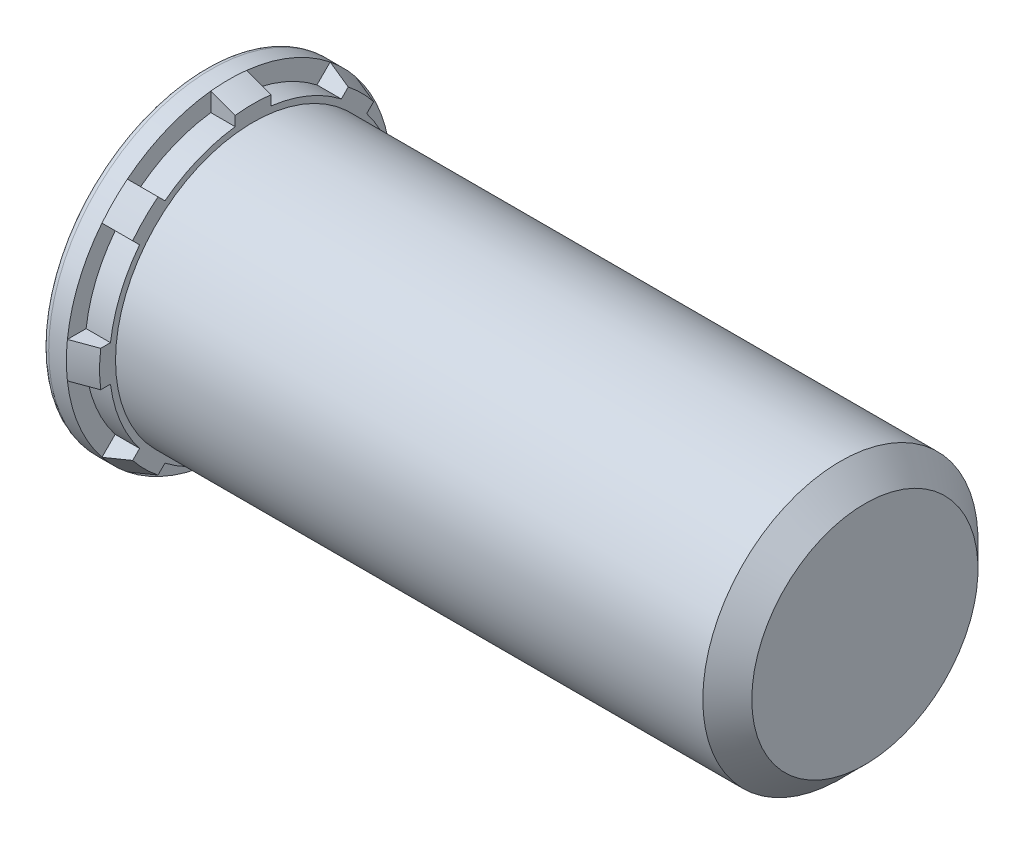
from build123d import *

# Parameters (mm, degrees)
RIBCUT_START     = -0.4425
RIBCUT_DEPTH     = 0.4425
RIBCUTSPAT_COUNT = 8
RIBCUTSPAT_ANGLE = 315


with BuildPart() as part:
    # BodySke → BaseBody (revolve)
    with BuildSketch(Plane.XY, mode=Mode.PRIVATE) as basebody_sk:
        with BuildLine():
            Line((-0.4425, 2.82946), (-0.4425, 0))
            Line((-0.4425, 0), (11.5575, 0))
            Line((11.5575, 0), (11.5575, 2.055))
            Line((11.5575, 2.055), (11.1125, 2.5))
            Line((11.1125, 2.5), (0.4425, 2.5))
            Line((0.4425, 2.5), (0.4425, 2.788943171))
            Line((0.4425, 2.788943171), (0, 2.95))
            Line((0, 2.95), (-0.32196, 2.95))
            ThreePointArc((-0.32196, 2.95), (-0.4053986, 2.9154386), (-0.43996, 2.832))
            Line((-0.43996, 2.832), (-0.43996, 2.82946))
            Line((-0.43996, 2.82946), (-0.4425, 2.82946))
        make_face()
    revolve(basebody_sk.sketch.rotate(Axis((0, 0, 0), (1, 0, 0)), 90), axis=Axis((0, 0, 0), (1, 0, 0)))

    # RibCutSke → RibCut (cut)
    with BuildSketch(Plane(origin=(0.4425, 1.794401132, -0.090952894), x_dir=(0, 0, -1), z_dir=(1, 0, 0)).offset(RIBCUT_START)):
        with BuildLine():
            Line((0.235362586, 0.797639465), (0.235362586, 1.137495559))
            ThreePointArc((0.235362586, 1.137495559), (1.037963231, 0.931043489), (1.751471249, 0.509502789))
            Line((1.751471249, 0.509502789), (1.5111567, 0.26918824))
            ThreePointArc((1.5111567, 0.26918824), (0.908807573, 0.619234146), (0.235362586, 0.797639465))
        make_face()
    ribcut = extrude(amount=RIBCUT_DEPTH, mode=Mode.SUBTRACT)

    # RibCutsPat: RibCut ×8 about axis
    ribcutspat_axis = Axis((0, 0, 0), (1, 0, 0))
    for i in range(1, RIBCUTSPAT_COUNT):
        add(ribcut.rotate(ribcutspat_axis, i * RIBCUTSPAT_ANGLE / (RIBCUTSPAT_COUNT - 1)), mode=Mode.SUBTRACT)


solid = part.part
